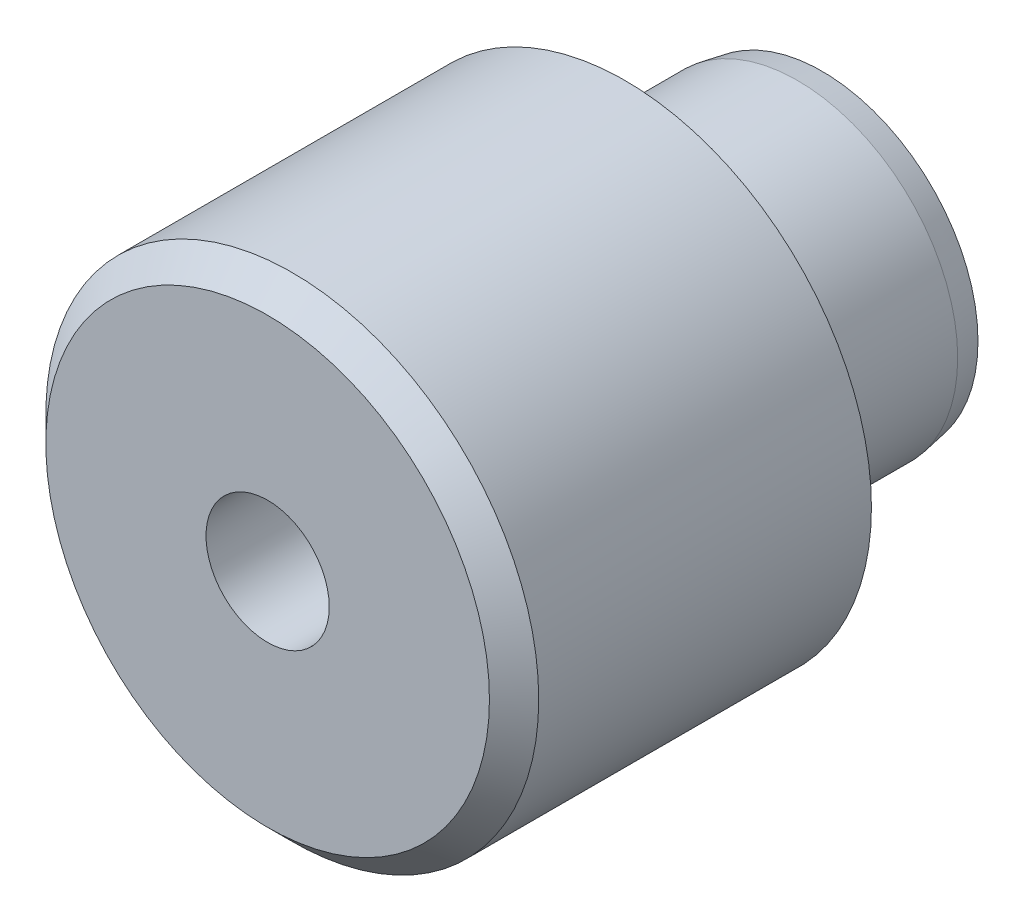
from build123d import *

# Parameters (mm, degrees)
SHOULDERFV_W                        = 10
SHOULDERFV_H                        = 14.5
M6X1_0_BOTTOMING_TAPPED_HOLE1_D     = 5
M6X1_0_BOTTOMING_TAPPED_HOLE1_DEPTH = 15
M6X1_0_BOTTOMING_TAPPED_HOLE1_TIP   = 1.502151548
FILLET1_R                           = 0.8
CHAMFER1_SIZE                       = 1


with BuildPart() as part:
    # ShoulderFV → Revolve1 (revolve)
    with BuildSketch(Plane(origin=(0, 0, 0), x_dir=(1, 0, 0), z_dir=(0, 1, 0))):
        with Locations((5, -7.75)):
            Rectangle(SHOULDERFV_W, SHOULDERFV_H)
    revolve(axis=Axis((0, 0, 0.5), (0, 0, -1)))

    # PinFV → Revolve2 (revolve)
    with BuildSketch(Plane(origin=(0, 0, 0), x_dir=(1, 0, 0), z_dir=(0, 1, 0))):
        Polygon((0, -0.5), (0, 7.5), (6.323673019, 7.5), (6.5, 6.5), (6.5, -0.5), align=None)
    revolve(axis=Axis((0, 0, -7.5), (0, 0, -1)))

    # M6x1.0 Bottoming Tapped Hole1
    with Locations(Plane.XY.offset(15)):
        with Locations((0, 0)):
            Hole(M6X1_0_BOTTOMING_TAPPED_HOLE1_D / 2, depth=M6X1_0_BOTTOMING_TAPPED_HOLE1_DEPTH)
            with Locations((0, 0, -(M6X1_0_BOTTOMING_TAPPED_HOLE1_DEPTH + M6X1_0_BOTTOMING_TAPPED_HOLE1_TIP / 2))):  # 118° drill point
                Cone(0, M6X1_0_BOTTOMING_TAPPED_HOLE1_D / 2, M6X1_0_BOTTOMING_TAPPED_HOLE1_TIP, mode=Mode.SUBTRACT)

    # Fillet1
    fillet1_edges = [part.edges().sort_by_distance(p)[0] for p in [
        (-6.5, 0, 0.5),
    ]]
    fillet(fillet1_edges, radius=FILLET1_R)

    # Chamfer1
    chamfer1_edges = [part.edges().sort_by_distance(p)[0] for p in [
        (-10, 0, 15),
    ]]
    chamfer(chamfer1_edges, length=CHAMFER1_SIZE)


solid = part.part
